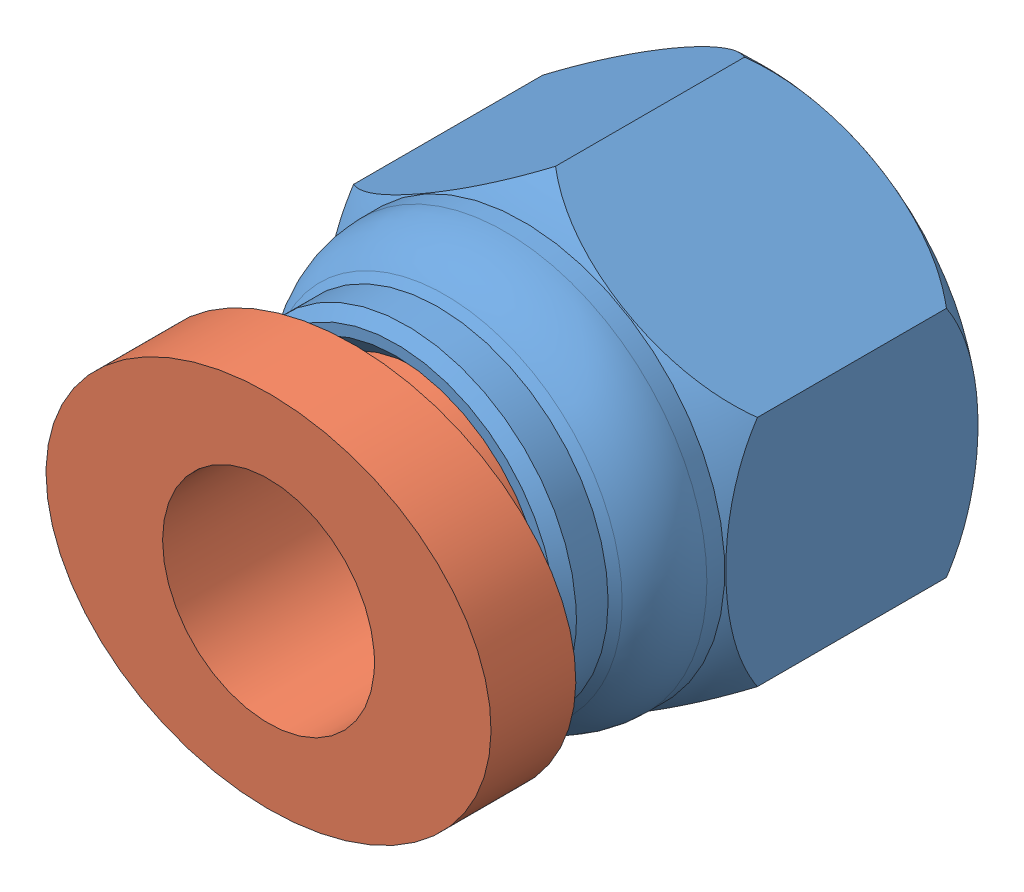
SolidWorks assembly connector.SLDASM, configuration Default (file format 12000). Lengths in mm.
Overall size (10.5 11.67 12.35).
2 component instances, 2 part files, 2 mates.
Components (placement in the parent):
- connector-1: connector.SLDPRT [Default] at (6.7006 8.9156 7.5553) size (9.53 11.67 9.35)
- connector_2-1: connector_2.SLDPRT [Default] at (6.7006 8.9156 17.5553) size (10.5 8.5 7)
Mates (geometry in assembly coordinates):
- Concentric1: concentric anti-aligned: circle of connector-1; cylinder of connector_2-1 through (6.7006 8.9156 19.5553) axis (0 0 -1) radius 2.5
- Distance1: distance = 1 mm anti-aligned: plane of connector_2-1 through (6.7006 8.9156 17.5553) normal (0 0 -1); plane of connector-1 through (6.7006 8.9156 16.5553) normal (0 0 1)
